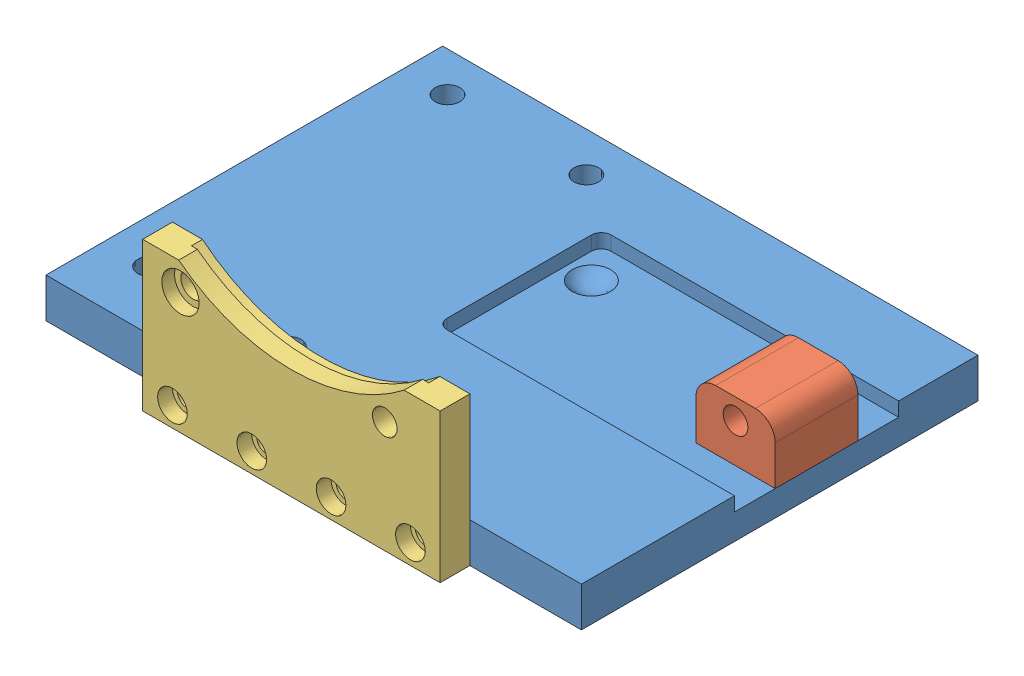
SolidWorks assembly Motor_Mount_Assem.SLDASM, configuration Default (file format 6000). Lengths in mm.
Overall size (171.45 47.62 136.53).
4 component instances, 4 part files, 12 mates.
Components (placement in the parent):
- 138_90H 3D-1: 138_90H 3D.SLDPRT [Default] at (4209.1731 -362.6348 -197.9765) x (-0.380175 -0.924914 0) z (0 0 -1) (suppressed, hidden)
- motor_mount_alum-1: motor_mount_alum.SLDPRT [Default] at (-88.1102 -87.3457 0) x (1 0 0) z (0 1 0) size (171.45 127 12.7)
- motor_mnt_block-1: motor_mnt_block.SLDPRT [Default] at (70.6398 -85.5169 -75.311) x (0 0 -1) z (0 1 0) size (26.52 25.4 19.05)
- motor_mnt_alum-vert-1: motor_mnt_alum-vert.SLDPRT [Default] at (0.0024 -93.6957 0) size (95.25 47.62 9.53)
Mates (geometry in assembly coordinates):
- Coincident1: coincident: axis of 138_90H 3D-1 through (0 0 -154) axis (0 0 1); plane of assembly
- Coincident2: coincident: axis of 138_90H 3D-1 through (0 0 -49.5) axis (0 0 -1); plane of assembly
- Parallel1: parallel anti-aligned: plane of 138_90H 3D-1 through (70.6398 -85.6217 -49.5) normal (0 -1 0); plane of assembly through (0 0 0) normal (0 1 0)
- Coincident4: coincident aligned: plane of 138_90H 3D-1 through (0 0 0) normal (0 0 1); plane of assembly through (0 0 0) normal (0 0 1)
- Coincident6: coincident aligned: plane of 138_90H 3D-1 through (0 0 0) normal (0 0 1); plane of motor_mount_alum-1 through (-88.1102 -80.9957 0) normal (0 0 1)
- Concentric3: concentric aligned: cylinder of motor_mount_alum-1 through (78.1836 -80.9957 -68.1736) axis (0 -1 0) radius 3.175; cylinder of motor_mnt_block-1 through (78.1836 -68.2449 -68.1736) axis (0 -1 0) radius 3.175
- Concentric4: concentric aligned: cylinder of motor_mount_alum-1 through (78.1836 -80.9957 -82.4484) axis (0 -1 0) radius 3.175; cylinder of motor_mnt_block-1 through (78.1836 -68.2449 -82.4484) axis (0 -1 0) radius 3.175
- Coincident7: coincident anti-aligned: plane of motor_mount_alum-1 through (-88.1102 -85.5169 0) normal (0 1 0); plane of motor_mnt_block-1 through (70.6398 -85.5169 -75.311) normal (0 -1 0)
- Parallel2: parallel anti-aligned: plane of 138_90H 3D-1 through (70.6398 -85.6217 -49.5) normal (0 -1 0); plane of motor_mount_alum-1 through (-88.1102 -85.5169 0) normal (0 1 0)
- Concentric5: concentric anti-aligned: cylinder of motor_mount_alum-1 through (-38.0976 -87.3457 -15.875) axis (0 0 1) radius 3.175; cylinder of motor_mnt_alum-vert-1 through (-38.0976 -87.3457 9.525) axis (0 0 -1) radius 3.175
- Concentric6: concentric anti-aligned: cylinder of motor_mount_alum-1 through (38.1024 -87.3457 -15.875) axis (0 0 1) radius 3.175; cylinder of motor_mnt_alum-vert-1 through (38.1024 -87.3457 9.525) axis (0 0 -1) radius 3.175
- Coincident9: coincident anti-aligned: plane of motor_mount_alum-1 through (-88.1102 -80.9957 0) normal (0 0 1); plane of motor_mnt_alum-vert-1 through (0.0024 -93.6957 0) normal (0 0 -1)
